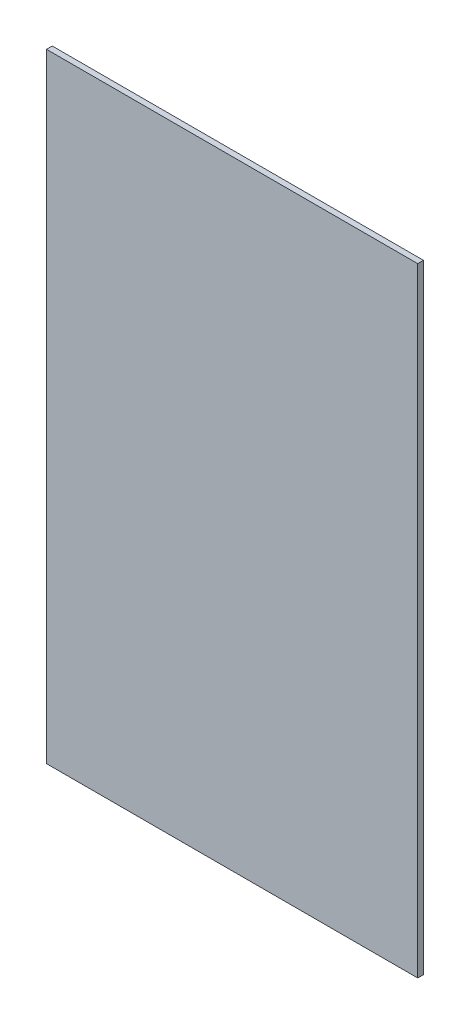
from build123d import *

# Parameters (mm, degrees)
SKETCH1_W           = 152.4
SKETCH1_H           = 254
BOSS_EXTRUDE1_DEPTH = 2.3622


with BuildPart() as part:
    # Sketch1 → Boss-Extrude1 (new body)
    with BuildSketch(Plane.XY):
        Rectangle(SKETCH1_W, SKETCH1_H)
    extrude(amount=BOSS_EXTRUDE1_DEPTH)


solid = part.part
